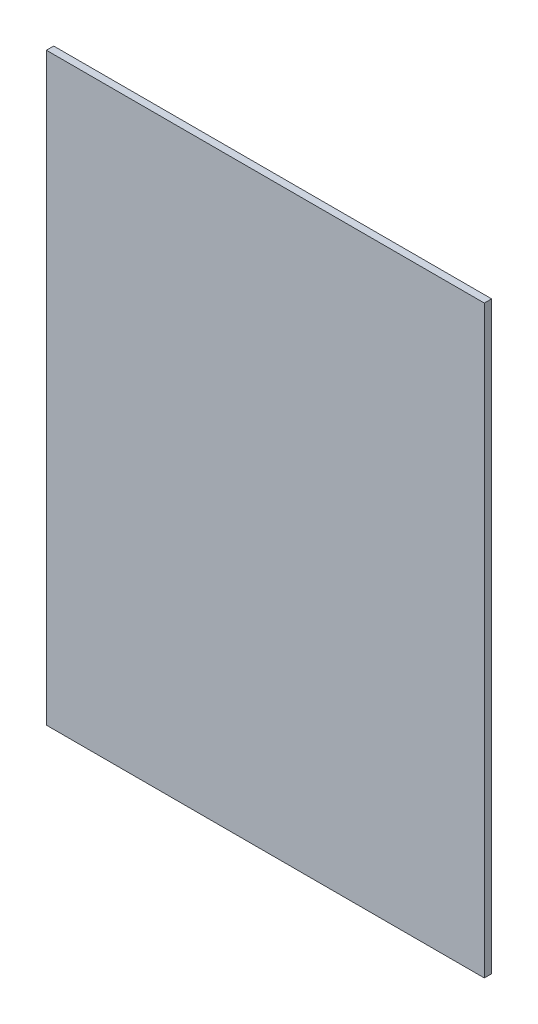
ISO-10303-21;
HEADER;
FILE_DESCRIPTION(('STEP AP214'),'2;1');
FILE_NAME('part.step','',(''),(''),'','','');
FILE_SCHEMA(('AUTOMOTIVE_DESIGN { 1 0 10303 214 1 1 1 1 }'));
ENDSEC;
DATA;
#1=APPLICATION_CONTEXT('core data for automotive mechanical design processes');
#2=APPLICATION_PROTOCOL_DEFINITION('international standard','automotive_design',2000,#1);
#3=PRODUCT_CONTEXT('',#1,'mechanical');
#4=PRODUCT('Part','Part','',(#3));
#5=PRODUCT_RELATED_PRODUCT_CATEGORY('part','',(#4));
#6=PRODUCT_DEFINITION_FORMATION('','',#4);
#7=PRODUCT_DEFINITION_CONTEXT('part definition',#1,'design');
#8=PRODUCT_DEFINITION('design','',#6,#7);
#9=PRODUCT_DEFINITION_SHAPE('','',#8);
#10=(LENGTH_UNIT() NAMED_UNIT(*) SI_UNIT(.MILLI.,.METRE.));
#11=(NAMED_UNIT(*) PLANE_ANGLE_UNIT() SI_UNIT($,.RADIAN.));
#12=(NAMED_UNIT(*) SI_UNIT($,.STERADIAN.) SOLID_ANGLE_UNIT());
#13=UNCERTAINTY_MEASURE_WITH_UNIT(LENGTH_MEASURE(1.E-05),#10,'distance_accuracy_value','');
#14=(GEOMETRIC_REPRESENTATION_CONTEXT(3) GLOBAL_UNCERTAINTY_ASSIGNED_CONTEXT((#13)) GLOBAL_UNIT_ASSIGNED_CONTEXT((#10,
#11,#12)) REPRESENTATION_CONTEXT('',''));
#15=CARTESIAN_POINT('',(0.,0.,0.));
#16=DIRECTION('',(0.,0.,1.));
#17=DIRECTION('',(1.,0.,0.));
#18=AXIS2_PLACEMENT_3D('',#15,#16,#17);
#19=CARTESIAN_POINT('',(0.29972,-0.40005,0.));
#20=DIRECTION('',(0.,-1.,0.));
#21=DIRECTION('',(-1.,0.,0.));
#22=AXIS2_PLACEMENT_3D('',#19,#20,#21);
#23=PLANE('',#22);
#24=DIRECTION('',(0.,0.,1.));
#25=VECTOR('',#24,1.);
#26=CARTESIAN_POINT('',(0.29972,-0.40005,0.));
#27=LINE('',#26,#25);
#28=CARTESIAN_POINT('',(0.29972,-0.40005,0.));
#29=VERTEX_POINT('',#28);
#30=CARTESIAN_POINT('',(0.29972,-0.40005,0.00999998));
#31=VERTEX_POINT('',#30);
#32=EDGE_CURVE('E11',#29,#31,#27,.T.);
#33=ORIENTED_EDGE('',*,*,#32,.T.);
#34=DIRECTION('',(-1.,0.,0.));
#35=VECTOR('',#34,1.);
#36=CARTESIAN_POINT('',(0.29972,-0.40005,0.00999998));
#37=LINE('',#36,#35);
#38=CARTESIAN_POINT('',(-0.29972,-0.40005,0.00999998));
#39=VERTEX_POINT('',#38);
#40=EDGE_CURVE('E25',#31,#39,#37,.T.);
#41=ORIENTED_EDGE('',*,*,#40,.T.);
#42=DIRECTION('',(0.,0.,1.));
#43=VECTOR('',#42,1.);
#44=CARTESIAN_POINT('',(-0.29972,-0.40005,0.));
#45=LINE('',#44,#43);
#46=CARTESIAN_POINT('',(-0.29972,-0.40005,0.));
#47=VERTEX_POINT('',#46);
#48=EDGE_CURVE('E73',#47,#39,#45,.T.);
#49=ORIENTED_EDGE('',*,*,#48,.F.);
#50=DIRECTION('',(-1.,0.,0.));
#51=VECTOR('',#50,1.);
#52=CARTESIAN_POINT('',(0.29972,-0.40005,0.));
#53=LINE('',#52,#51);
#54=EDGE_CURVE('E99',#29,#47,#53,.T.);
#55=ORIENTED_EDGE('',*,*,#54,.F.);
#56=EDGE_LOOP('',(#33,#41,#49,#55));
#57=FACE_BOUND('',#56,.T.);
#58=ADVANCED_FACE('F17',(#57),#23,.T.);
#59=CARTESIAN_POINT('',(-6.349989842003E-07,9.069774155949E-07,0.));
#60=DIRECTION('',(0.,0.,-1.));
#61=DIRECTION('',(-1.,0.,0.));
#62=AXIS2_PLACEMENT_3D('',#59,#60,#61);
#63=PLANE('',#62);
#64=ORIENTED_EDGE('',*,*,#54,.T.);
#65=DIRECTION('',(0.,1.,0.));
#66=VECTOR('',#65,1.);
#67=CARTESIAN_POINT('',(-0.29972,-0.40005,0.));
#68=LINE('',#67,#66);
#69=CARTESIAN_POINT('',(-0.29972,0.40005254,0.));
#70=VERTEX_POINT('',#69);
#71=EDGE_CURVE('E95',#47,#70,#68,.T.);
#72=ORIENTED_EDGE('',*,*,#71,.T.);
#73=DIRECTION('',(1.,0.,0.));
#74=VECTOR('',#73,1.);
#75=CARTESIAN_POINT('',(-0.29972,0.40005254,0.));
#76=LINE('',#75,#74);
#77=CARTESIAN_POINT('',(0.29971746,0.40005254,0.));
#78=VERTEX_POINT('',#77);
#79=EDGE_CURVE('E68',#70,#78,#76,.T.);
#80=ORIENTED_EDGE('',*,*,#79,.T.);
#81=DIRECTION('',(3.17459305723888E-06,-0.999999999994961,0.));
#82=VECTOR('',#81,1.);
#83=CARTESIAN_POINT('',(0.29971746,0.40005254,0.));
#84=LINE('',#83,#82);
#85=EDGE_CURVE('E87',#78,#29,#84,.T.);
#86=ORIENTED_EDGE('',*,*,#85,.T.);
#87=EDGE_LOOP('',(#64,#72,#80,#86));
#88=FACE_BOUND('',#87,.T.);
#89=ADVANCED_FACE('F112',(#88),#63,.T.);
#90=CARTESIAN_POINT('',(0.29971746,0.40005254,0.));
#91=DIRECTION('',(0.999999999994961,3.17459305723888E-06,0.));
#92=DIRECTION('',(3.17459305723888E-06,-0.999999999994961,0.));
#93=AXIS2_PLACEMENT_3D('',#90,#91,#92);
#94=PLANE('',#93);
#95=DIRECTION('',(0.,0.,1.));
#96=VECTOR('',#95,1.);
#97=CARTESIAN_POINT('',(0.29971746,0.40005254,0.));
#98=LINE('',#97,#96);
#99=CARTESIAN_POINT('',(0.29971746,0.40005254,0.00999998));
#100=VERTEX_POINT('',#99);
#101=EDGE_CURVE('E83',#78,#100,#98,.T.);
#102=ORIENTED_EDGE('',*,*,#101,.T.);
#103=DIRECTION('',(3.17459305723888E-06,-0.999999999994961,0.));
#104=VECTOR('',#103,1.);
#105=CARTESIAN_POINT('',(0.29971746,0.40005254,0.00999998));
#106=LINE('',#105,#104);
#107=EDGE_CURVE('E60',#100,#31,#106,.T.);
#108=ORIENTED_EDGE('',*,*,#107,.T.);
#109=ORIENTED_EDGE('',*,*,#32,.F.);
#110=ORIENTED_EDGE('',*,*,#85,.F.);
#111=EDGE_LOOP('',(#102,#108,#109,#110));
#112=FACE_BOUND('',#111,.T.);
#113=ADVANCED_FACE('F119',(#112),#94,.T.);
#114=CARTESIAN_POINT('',(-6.349989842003E-07,9.069774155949E-07,0.00999998));
#115=DIRECTION('',(0.,0.,-1.));
#116=DIRECTION('',(-1.,0.,0.));
#117=AXIS2_PLACEMENT_3D('',#114,#115,#116);
#118=PLANE('',#117);
#119=ORIENTED_EDGE('',*,*,#107,.F.);
#120=DIRECTION('',(1.,0.,0.));
#121=VECTOR('',#120,1.);
#122=CARTESIAN_POINT('',(-0.29972,0.40005254,0.00999998));
#123=LINE('',#122,#121);
#124=CARTESIAN_POINT('',(-0.29972,0.40005254,0.00999998));
#125=VERTEX_POINT('',#124);
#126=EDGE_CURVE('E54',#125,#100,#123,.T.);
#127=ORIENTED_EDGE('',*,*,#126,.F.);
#128=DIRECTION('',(0.,1.,0.));
#129=VECTOR('',#128,1.);
#130=CARTESIAN_POINT('',(-0.29972,-0.40005,0.00999998));
#131=LINE('',#130,#129);
#132=EDGE_CURVE('E58',#39,#125,#131,.T.);
#133=ORIENTED_EDGE('',*,*,#132,.F.);
#134=ORIENTED_EDGE('',*,*,#40,.F.);
#135=EDGE_LOOP('',(#119,#127,#133,#134));
#136=FACE_BOUND('',#135,.T.);
#137=ADVANCED_FACE('F56',(#136),#118,.F.);
#138=CARTESIAN_POINT('',(-0.29972,-0.40005,0.));
#139=DIRECTION('',(-1.,0.,0.));
#140=DIRECTION('',(0.,1.,0.));
#141=AXIS2_PLACEMENT_3D('',#138,#139,#140);
#142=PLANE('',#141);
#143=ORIENTED_EDGE('',*,*,#48,.T.);
#144=ORIENTED_EDGE('',*,*,#132,.T.);
#145=DIRECTION('',(0.,0.,1.));
#146=VECTOR('',#145,1.);
#147=CARTESIAN_POINT('',(-0.29972,0.40005254,0.));
#148=LINE('',#147,#146);
#149=EDGE_CURVE('E66',#70,#125,#148,.T.);
#150=ORIENTED_EDGE('',*,*,#149,.F.);
#151=ORIENTED_EDGE('',*,*,#71,.F.);
#152=EDGE_LOOP('',(#143,#144,#150,#151));
#153=FACE_BOUND('',#152,.T.);
#154=ADVANCED_FACE('F72',(#153),#142,.T.);
#155=CARTESIAN_POINT('',(-0.29972,0.40005254,0.));
#156=DIRECTION('',(0.,1.,0.));
#157=DIRECTION('',(1.,0.,0.));
#158=AXIS2_PLACEMENT_3D('',#155,#156,#157);
#159=PLANE('',#158);
#160=ORIENTED_EDGE('',*,*,#149,.T.);
#161=ORIENTED_EDGE('',*,*,#126,.T.);
#162=ORIENTED_EDGE('',*,*,#101,.F.);
#163=ORIENTED_EDGE('',*,*,#79,.F.);
#164=EDGE_LOOP('',(#160,#161,#162,#163));
#165=FACE_BOUND('',#164,.T.);
#166=ADVANCED_FACE('F67',(#165),#159,.T.);
#167=CLOSED_SHELL('',(#58,#89,#113,#137,#154,#166));
#168=MANIFOLD_SOLID_BREP('B1',#167);
#169=ADVANCED_BREP_SHAPE_REPRESENTATION('',(#18,#168),#14);
#170=SHAPE_DEFINITION_REPRESENTATION(#9,#169);
ENDSEC;
END-ISO-10303-21;
